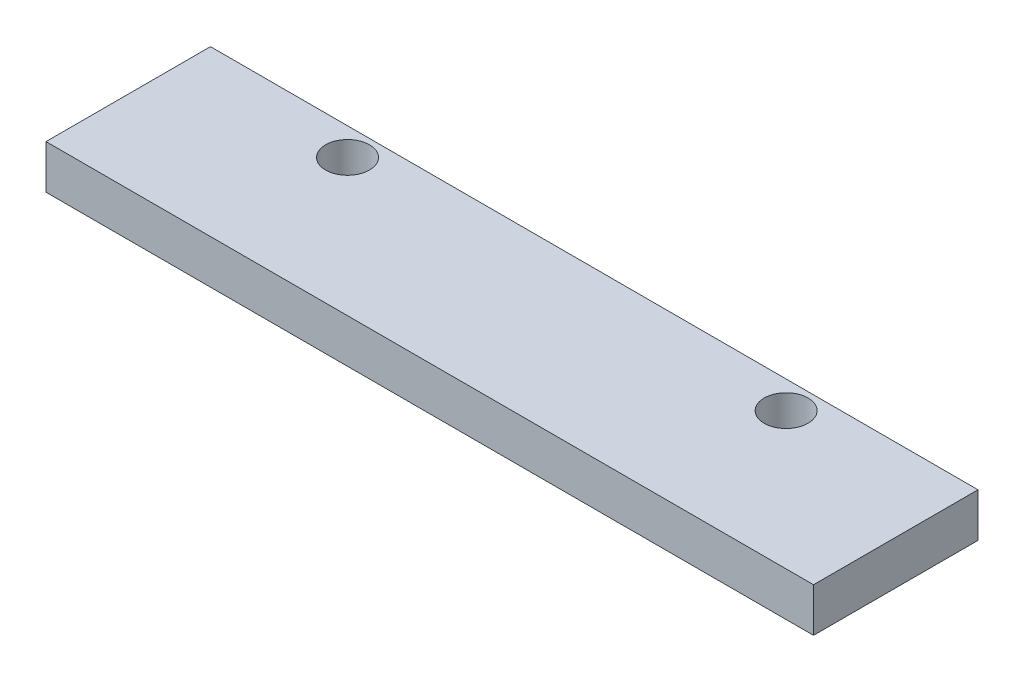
ISO-10303-21;
HEADER;
FILE_DESCRIPTION(('STEP AP214'),'2;1');
FILE_NAME('part.step','',(''),(''),'','','');
FILE_SCHEMA(('AUTOMOTIVE_DESIGN { 1 0 10303 214 1 1 1 1 }'));
ENDSEC;
DATA;
#1=APPLICATION_CONTEXT('core data for automotive mechanical design processes');
#2=APPLICATION_PROTOCOL_DEFINITION('international standard','automotive_design',2000,#1);
#3=PRODUCT_CONTEXT('',#1,'mechanical');
#4=PRODUCT('Part','Part','',(#3));
#5=PRODUCT_RELATED_PRODUCT_CATEGORY('part','',(#4));
#6=PRODUCT_DEFINITION_FORMATION('','',#4);
#7=PRODUCT_DEFINITION_CONTEXT('part definition',#1,'design');
#8=PRODUCT_DEFINITION('design','',#6,#7);
#9=PRODUCT_DEFINITION_SHAPE('','',#8);
#10=(LENGTH_UNIT() NAMED_UNIT(*) SI_UNIT(.MILLI.,.METRE.));
#11=(NAMED_UNIT(*) PLANE_ANGLE_UNIT() SI_UNIT($,.RADIAN.));
#12=(NAMED_UNIT(*) SI_UNIT($,.STERADIAN.) SOLID_ANGLE_UNIT());
#13=UNCERTAINTY_MEASURE_WITH_UNIT(LENGTH_MEASURE(1.E-05),#10,'distance_accuracy_value','');
#14=(GEOMETRIC_REPRESENTATION_CONTEXT(3) GLOBAL_UNCERTAINTY_ASSIGNED_CONTEXT((#13)) GLOBAL_UNIT_ASSIGNED_CONTEXT((#10,
#11,#12)) REPRESENTATION_CONTEXT('',''));
#15=CARTESIAN_POINT('',(0.,0.,0.));
#16=DIRECTION('',(0.,0.,1.));
#17=DIRECTION('',(1.,0.,0.));
#18=AXIS2_PLACEMENT_3D('',#15,#16,#17);
#19=CARTESIAN_POINT('',(0.,0.,15.));
#20=DIRECTION('',(1.,0.,0.));
#21=DIRECTION('',(0.,0.,-1.));
#22=AXIS2_PLACEMENT_3D('',#19,#20,#21);
#23=PLANE('',#22);
#24=DIRECTION('',(0.,-1.,0.));
#25=VECTOR('',#24,1.);
#26=CARTESIAN_POINT('',(0.,0.,0.));
#27=LINE('',#26,#25);
#28=CARTESIAN_POINT('',(0.,4.,0.));
#29=VERTEX_POINT('',#28);
#30=CARTESIAN_POINT('',(0.,0.,0.));
#31=VERTEX_POINT('',#30);
#32=EDGE_CURVE('E403',#29,#31,#27,.T.);
#33=ORIENTED_EDGE('',*,*,#32,.T.);
#34=DIRECTION('',(0.,0.,-1.));
#35=VECTOR('',#34,1.);
#36=CARTESIAN_POINT('',(0.,0.,15.));
#37=LINE('',#36,#35);
#38=CARTESIAN_POINT('',(0.,0.,15.));
#39=VERTEX_POINT('',#38);
#40=EDGE_CURVE('E412',#39,#31,#37,.T.);
#41=ORIENTED_EDGE('',*,*,#40,.F.);
#42=DIRECTION('',(0.,-1.,0.));
#43=VECTOR('',#42,1.);
#44=CARTESIAN_POINT('',(0.,0.,15.));
#45=LINE('',#44,#43);
#46=CARTESIAN_POINT('',(0.,4.,15.));
#47=VERTEX_POINT('',#46);
#48=EDGE_CURVE('E435',#47,#39,#45,.T.);
#49=ORIENTED_EDGE('',*,*,#48,.F.);
#50=DIRECTION('',(0.,0.,-1.));
#51=VECTOR('',#50,1.);
#52=CARTESIAN_POINT('',(0.,4.,15.));
#53=LINE('',#52,#51);
#54=EDGE_CURVE('E424',#47,#29,#53,.T.);
#55=ORIENTED_EDGE('',*,*,#54,.T.);
#56=EDGE_LOOP('',(#33,#41,#49,#55));
#57=FACE_BOUND('',#56,.T.);
#58=ADVANCED_FACE('F354',(#57),#23,.F.);
#59=CARTESIAN_POINT('',(0.,0.,15.));
#60=DIRECTION('',(0.,1.,0.));
#61=DIRECTION('',(0.,0.,1.));
#62=AXIS2_PLACEMENT_3D('',#59,#60,#61);
#63=PLANE('',#62);
#64=DIRECTION('',(1.,0.,0.));
#65=VECTOR('',#64,1.);
#66=CARTESIAN_POINT('',(0.,0.,0.));
#67=LINE('',#66,#65);
#68=CARTESIAN_POINT('',(15.,0.,0.));
#69=VERTEX_POINT('',#68);
#70=EDGE_CURVE('E398',#31,#69,#67,.T.);
#71=ORIENTED_EDGE('',*,*,#70,.T.);
#72=CARTESIAN_POINT('',(15.,0.,2.49999999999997));
#73=DIRECTION('',(0.,1.,0.));
#74=DIRECTION('',(0.,0.,1.));
#75=AXIS2_PLACEMENT_3D('',#72,#73,#74);
#76=CIRCLE('',#75,2.5);
#77=EDGE_CURVE('E361',#69,#69,#76,.T.);
#78=ORIENTED_EDGE('',*,*,#77,.T.);
#79=CARTESIAN_POINT('',(55.,0.,0.));
#80=VERTEX_POINT('',#79);
#81=EDGE_CURVE('E406',#69,#80,#67,.T.);
#82=ORIENTED_EDGE('',*,*,#81,.T.);
#83=CARTESIAN_POINT('',(55.,0.,2.49999999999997));
#84=DIRECTION('',(0.,1.,0.));
#85=DIRECTION('',(0.,0.,1.));
#86=AXIS2_PLACEMENT_3D('',#83,#84,#85);
#87=CIRCLE('',#86,2.50000000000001);
#88=EDGE_CURVE('E366',#80,#80,#87,.T.);
#89=ORIENTED_EDGE('',*,*,#88,.T.);
#90=CARTESIAN_POINT('',(70.,0.,0.));
#91=VERTEX_POINT('',#90);
#92=EDGE_CURVE('E410',#80,#91,#67,.T.);
#93=ORIENTED_EDGE('',*,*,#92,.T.);
#94=DIRECTION('',(0.,0.,-1.));
#95=VECTOR('',#94,1.);
#96=CARTESIAN_POINT('',(70.,0.,15.));
#97=LINE('',#96,#95);
#98=CARTESIAN_POINT('',(70.,0.,15.));
#99=VERTEX_POINT('',#98);
#100=EDGE_CURVE('E420',#99,#91,#97,.T.);
#101=ORIENTED_EDGE('',*,*,#100,.F.);
#102=DIRECTION('',(1.,0.,0.));
#103=VECTOR('',#102,1.);
#104=CARTESIAN_POINT('',(0.,0.,15.));
#105=LINE('',#104,#103);
#106=EDGE_CURVE('E415',#39,#99,#105,.T.);
#107=ORIENTED_EDGE('',*,*,#106,.F.);
#108=ORIENTED_EDGE('',*,*,#40,.T.);
#109=EDGE_LOOP('',(#71,#78,#82,#89,#93,#101,#107,#108));
#110=FACE_BOUND('',#109,.T.);
#111=ADVANCED_FACE('F413',(#110),#63,.F.);
#112=CARTESIAN_POINT('',(70.,0.,15.));
#113=DIRECTION('',(-1.,0.,0.));
#114=DIRECTION('',(0.,0.,1.));
#115=AXIS2_PLACEMENT_3D('',#112,#113,#114);
#116=PLANE('',#115);
#117=DIRECTION('',(0.,1.,0.));
#118=VECTOR('',#117,1.);
#119=CARTESIAN_POINT('',(70.,0.,0.));
#120=LINE('',#119,#118);
#121=CARTESIAN_POINT('',(70.,4.,0.));
#122=VERTEX_POINT('',#121);
#123=EDGE_CURVE('E408',#91,#122,#120,.T.);
#124=ORIENTED_EDGE('',*,*,#123,.T.);
#125=DIRECTION('',(0.,0.,-1.));
#126=VECTOR('',#125,1.);
#127=CARTESIAN_POINT('',(70.,4.,15.));
#128=LINE('',#127,#126);
#129=CARTESIAN_POINT('',(70.,4.,15.));
#130=VERTEX_POINT('',#129);
#131=EDGE_CURVE('E443',#130,#122,#128,.T.);
#132=ORIENTED_EDGE('',*,*,#131,.F.);
#133=DIRECTION('',(0.,1.,0.));
#134=VECTOR('',#133,1.);
#135=CARTESIAN_POINT('',(70.,0.,15.));
#136=LINE('',#135,#134);
#137=EDGE_CURVE('E438',#99,#130,#136,.T.);
#138=ORIENTED_EDGE('',*,*,#137,.F.);
#139=ORIENTED_EDGE('',*,*,#100,.T.);
#140=EDGE_LOOP('',(#124,#132,#138,#139));
#141=FACE_BOUND('',#140,.T.);
#142=ADVANCED_FACE('F453',(#141),#116,.F.);
#143=CARTESIAN_POINT('',(0.,4.,15.));
#144=DIRECTION('',(0.,-1.,0.));
#145=DIRECTION('',(0.,0.,-1.));
#146=AXIS2_PLACEMENT_3D('',#143,#144,#145);
#147=PLANE('',#146);
#148=CARTESIAN_POINT('',(15.,4.,2.49999999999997));
#149=DIRECTION('',(0.,-1.,0.));
#150=DIRECTION('',(0.,0.,-1.));
#151=AXIS2_PLACEMENT_3D('',#148,#149,#150);
#152=CIRCLE('',#151,2.);
#153=CARTESIAN_POINT('',(15.,4.,0.499999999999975));
#154=VERTEX_POINT('',#153);
#155=EDGE_CURVE('E428',#154,#154,#152,.T.);
#156=ORIENTED_EDGE('',*,*,#155,.T.);
#157=EDGE_LOOP('',(#156));
#158=FACE_BOUND('',#157,.T.);
#159=CARTESIAN_POINT('',(55.,4.,2.49999999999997));
#160=DIRECTION('',(0.,-1.,0.));
#161=DIRECTION('',(0.,0.,-1.));
#162=AXIS2_PLACEMENT_3D('',#159,#160,#161);
#163=CIRCLE('',#162,2.);
#164=CARTESIAN_POINT('',(55.,4.,0.499999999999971));
#165=VERTEX_POINT('',#164);
#166=EDGE_CURVE('E425',#165,#165,#163,.T.);
#167=ORIENTED_EDGE('',*,*,#166,.T.);
#168=EDGE_LOOP('',(#167));
#169=FACE_BOUND('',#168,.T.);
#170=DIRECTION('',(-1.,0.,0.));
#171=VECTOR('',#170,1.);
#172=CARTESIAN_POINT('',(0.,4.,0.));
#173=LINE('',#172,#171);
#174=EDGE_CURVE('E433',#122,#29,#173,.T.);
#175=ORIENTED_EDGE('',*,*,#174,.T.);
#176=ORIENTED_EDGE('',*,*,#54,.F.);
#177=DIRECTION('',(-1.,0.,0.));
#178=VECTOR('',#177,1.);
#179=CARTESIAN_POINT('',(0.,4.,15.));
#180=LINE('',#179,#178);
#181=EDGE_CURVE('E440',#130,#47,#180,.T.);
#182=ORIENTED_EDGE('',*,*,#181,.F.);
#183=ORIENTED_EDGE('',*,*,#131,.T.);
#184=EDGE_LOOP('',(#175,#176,#182,#183));
#185=FACE_BOUND('',#184,.T.);
#186=ADVANCED_FACE('F457',(#158,#169,#185),#147,.F.);
#187=CARTESIAN_POINT('',(0.,4.,15.));
#188=DIRECTION('',(0.,0.,-1.));
#189=DIRECTION('',(-1.,0.,0.));
#190=AXIS2_PLACEMENT_3D('',#187,#188,#189);
#191=PLANE('',#190);
#192=ORIENTED_EDGE('',*,*,#48,.T.);
#193=ORIENTED_EDGE('',*,*,#106,.T.);
#194=ORIENTED_EDGE('',*,*,#137,.T.);
#195=ORIENTED_EDGE('',*,*,#181,.T.);
#196=EDGE_LOOP('',(#192,#193,#194,#195));
#197=FACE_BOUND('',#196,.T.);
#198=ADVANCED_FACE('F459',(#197),#191,.F.);
#199=CARTESIAN_POINT('',(0.,4.,0.));
#200=DIRECTION('',(0.,0.,-1.));
#201=DIRECTION('',(-1.,0.,0.));
#202=AXIS2_PLACEMENT_3D('',#199,#200,#201);
#203=PLANE('',#202);
#204=ORIENTED_EDGE('',*,*,#32,.F.);
#205=ORIENTED_EDGE('',*,*,#174,.F.);
#206=ORIENTED_EDGE('',*,*,#123,.F.);
#207=ORIENTED_EDGE('',*,*,#92,.F.);
#208=ORIENTED_EDGE('',*,*,#81,.F.);
#209=ORIENTED_EDGE('',*,*,#70,.F.);
#210=EDGE_LOOP('',(#204,#205,#206,#207,#208,#209));
#211=FACE_BOUND('',#210,.T.);
#212=ADVANCED_FACE('F400',(#211),#203,.T.);
#213=CARTESIAN_POINT('',(55.,4.,2.49999999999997));
#214=DIRECTION('',(0.,-1.,0.));
#215=DIRECTION('',(0.,0.,-1.));
#216=AXIS2_PLACEMENT_3D('',#213,#214,#215);
#217=CYLINDRICAL_SURFACE('',#216,2.);
#218=CARTESIAN_POINT('',(55.,0.500000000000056,2.49999999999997));
#219=DIRECTION('',(0.,1.,0.));
#220=DIRECTION('',(0.,0.,1.));
#221=AXIS2_PLACEMENT_3D('',#218,#219,#220);
#222=CIRCLE('',#221,2.);
#223=CARTESIAN_POINT('',(55.,0.500000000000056,4.49999999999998));
#224=VERTEX_POINT('',#223);
#225=EDGE_CURVE('E11',#224,#224,#222,.F.);
#226=ORIENTED_EDGE('',*,*,#225,.T.);
#227=EDGE_LOOP('',(#226));
#228=FACE_BOUND('',#227,.T.);
#229=ORIENTED_EDGE('',*,*,#166,.F.);
#230=EDGE_LOOP('',(#229));
#231=FACE_BOUND('',#230,.T.);
#232=ADVANCED_FACE('F466',(#228,#231),#217,.F.);
#233=CARTESIAN_POINT('',(15.,4.,2.49999999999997));
#234=DIRECTION('',(0.,-1.,0.));
#235=DIRECTION('',(0.,0.,-1.));
#236=AXIS2_PLACEMENT_3D('',#233,#234,#235);
#237=CYLINDRICAL_SURFACE('',#236,2.);
#238=CARTESIAN_POINT('',(15.,0.500000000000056,2.49999999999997));
#239=DIRECTION('',(0.,1.,0.));
#240=DIRECTION('',(0.,0.,1.));
#241=AXIS2_PLACEMENT_3D('',#238,#239,#240);
#242=CIRCLE('',#241,2.);
#243=CARTESIAN_POINT('',(15.,0.500000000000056,4.49999999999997));
#244=VERTEX_POINT('',#243);
#245=EDGE_CURVE('E419',#244,#244,#242,.F.);
#246=ORIENTED_EDGE('',*,*,#245,.T.);
#247=EDGE_LOOP('',(#246));
#248=FACE_BOUND('',#247,.T.);
#249=ORIENTED_EDGE('',*,*,#155,.F.);
#250=EDGE_LOOP('',(#249));
#251=FACE_BOUND('',#250,.T.);
#252=ADVANCED_FACE('F485',(#248,#251),#237,.F.);
#253=CARTESIAN_POINT('',(15.,0.500000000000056,2.49999999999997));
#254=DIRECTION('',(0.,-1.,0.));
#255=DIRECTION('',(0.,0.,-1.));
#256=AXIS2_PLACEMENT_3D('',#253,#254,#255);
#257=CONICAL_SURFACE('',#256,2.,0.78539816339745);
#258=ORIENTED_EDGE('',*,*,#77,.F.);
#259=EDGE_LOOP('',(#258));
#260=FACE_BOUND('',#259,.T.);
#261=ORIENTED_EDGE('',*,*,#245,.F.);
#262=EDGE_LOOP('',(#261));
#263=FACE_BOUND('',#262,.T.);
#264=ADVANCED_FACE('F489',(#260,#263),#257,.F.);
#265=CARTESIAN_POINT('',(55.,0.500000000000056,2.49999999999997));
#266=DIRECTION('',(0.,-1.,0.));
#267=DIRECTION('',(0.,0.,-1.));
#268=AXIS2_PLACEMENT_3D('',#265,#266,#267);
#269=CONICAL_SURFACE('',#268,2.,0.78539816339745);
#270=ORIENTED_EDGE('',*,*,#88,.F.);
#271=EDGE_LOOP('',(#270));
#272=FACE_BOUND('',#271,.T.);
#273=ORIENTED_EDGE('',*,*,#225,.F.);
#274=EDGE_LOOP('',(#273));
#275=FACE_BOUND('',#274,.T.);
#276=ADVANCED_FACE('F493',(#272,#275),#269,.F.);
#277=CLOSED_SHELL('',(#58,#111,#142,#186,#198,#212,#232,#252,#264,#276));
#278=MANIFOLD_SOLID_BREP('B2',#277);
#279=ADVANCED_BREP_SHAPE_REPRESENTATION('',(#18,#278),#14);
#280=SHAPE_DEFINITION_REPRESENTATION(#9,#279);
ENDSEC;
END-ISO-10303-21;
